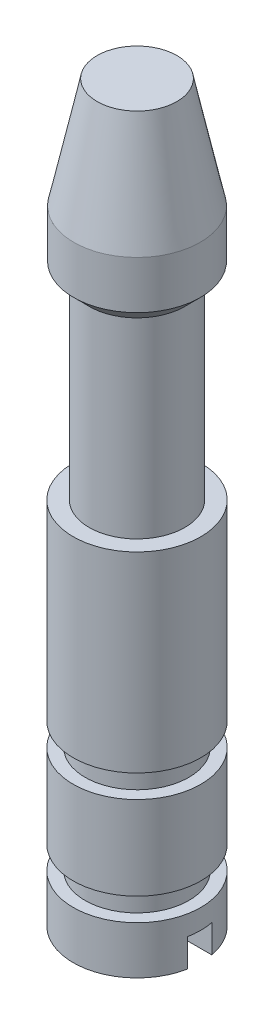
from build123d import *

# Parameters (mm, degrees)
SKETCH2_W      = 6.35
SKETCH2_H      = 1.2192
EXTRUDE1_DEPTH = 1.397


with BuildPart() as part:
    # Sketch1 → Revolve1 (revolve)
    with BuildSketch(Plane.XY, mode=Mode.PRIVATE) as revolve1_sk:
        Polygon((0, 36.5125), (1.984375, 36.5125), (3.1496, 31.030547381), (3.1496, 28.649297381), (2.38125, 27.880947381), (2.38125, 18.355947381), (3.175, 18.355947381), (3.175, 8.830947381), (2.5796875, 8.830947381), (2.5796875, 7.687947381), (3.175, 7.687947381), (3.175, 3.52425), (2.5796875, 3.52425), (2.5796875, 2.38125), (3.175, 2.38125), (3.175, 0), (0, 0), align=None)
    revolve(revolve1_sk.sketch.rotate(Axis((0, 36.5125, 0), (0, 1, 0)), 90), axis=Axis((0, 36.5125, 0), (0, 1, 0)))

    # Sketch2 → Extrude1 (cut)
    with BuildSketch(Plane.XZ):
        Rectangle(SKETCH2_W, SKETCH2_H)
    extrude(amount=-EXTRUDE1_DEPTH, mode=Mode.SUBTRACT)


solid = part.part
